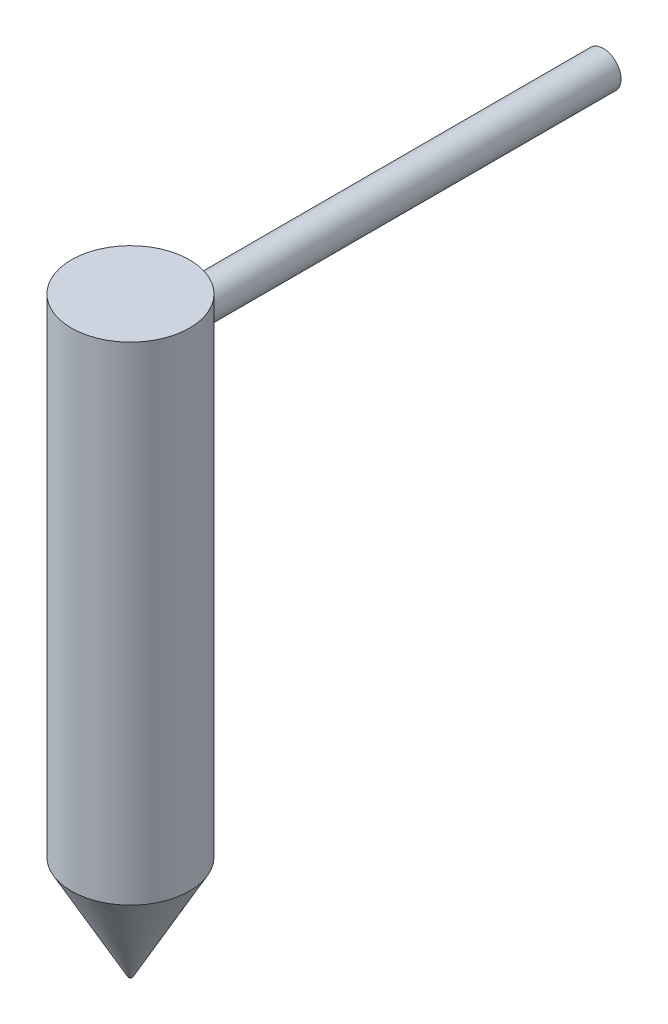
ISO-10303-21;
HEADER;
FILE_DESCRIPTION(('STEP AP214'),'2;1');
FILE_NAME('part.step','',(''),(''),'','','');
FILE_SCHEMA(('AUTOMOTIVE_DESIGN { 1 0 10303 214 1 1 1 1 }'));
ENDSEC;
DATA;
#1=APPLICATION_CONTEXT('core data for automotive mechanical design processes');
#2=APPLICATION_PROTOCOL_DEFINITION('international standard','automotive_design',2000,#1);
#3=PRODUCT_CONTEXT('',#1,'mechanical');
#4=PRODUCT('Part','Part','',(#3));
#5=PRODUCT_RELATED_PRODUCT_CATEGORY('part','',(#4));
#6=PRODUCT_DEFINITION_FORMATION('','',#4);
#7=PRODUCT_DEFINITION_CONTEXT('part definition',#1,'design');
#8=PRODUCT_DEFINITION('design','',#6,#7);
#9=PRODUCT_DEFINITION_SHAPE('','',#8);
#10=(LENGTH_UNIT() NAMED_UNIT(*) SI_UNIT(.MILLI.,.METRE.));
#11=(NAMED_UNIT(*) PLANE_ANGLE_UNIT() SI_UNIT($,.RADIAN.));
#12=(NAMED_UNIT(*) SI_UNIT($,.STERADIAN.) SOLID_ANGLE_UNIT());
#13=UNCERTAINTY_MEASURE_WITH_UNIT(LENGTH_MEASURE(1.E-05),#10,'distance_accuracy_value','');
#14=(GEOMETRIC_REPRESENTATION_CONTEXT(3) GLOBAL_UNCERTAINTY_ASSIGNED_CONTEXT((#13)) GLOBAL_UNIT_ASSIGNED_CONTEXT((#10,
#11,#12)) REPRESENTATION_CONTEXT('',''));
#15=CARTESIAN_POINT('',(0.,0.,0.));
#16=DIRECTION('',(0.,0.,1.));
#17=DIRECTION('',(1.,0.,0.));
#18=AXIS2_PLACEMENT_3D('',#15,#16,#17);
#19=CARTESIAN_POINT('',(0.,-500.,0.));
#20=DIRECTION('',(0.,1.,0.));
#21=DIRECTION('',(0.,0.,1.));
#22=AXIS2_PLACEMENT_3D('',#19,#20,#21);
#23=CYLINDRICAL_SURFACE('',#22,50.);
#24=CARTESIAN_POINT('',(15.,-35.1316147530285,-47.6969600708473));
#25=CARTESIAN_POINT('',(14.9999991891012,-35.5426036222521,-47.6969606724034));
#26=CARTESIAN_POINT('',(14.9830945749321,-35.953606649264,-47.7022865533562));
#27=CARTESIAN_POINT('',(14.9156320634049,-36.7725774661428,-47.7234235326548));
#28=CARTESIAN_POINT('',(14.86507260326,-37.1805451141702,-47.7392351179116));
#29=CARTESIAN_POINT('',(14.730748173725,-37.9905752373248,-47.780853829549));
#30=CARTESIAN_POINT('',(14.6469736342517,-38.3926359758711,-47.8066638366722));
#31=CARTESIAN_POINT('',(14.4469666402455,-39.1878771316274,-47.8674843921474));
#32=CARTESIAN_POINT('',(14.3307343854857,-39.5810576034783,-47.9024948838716));
#33=CARTESIAN_POINT('',(14.0670197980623,-40.3552044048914,-47.9805982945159));
#34=CARTESIAN_POINT('',(13.9195908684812,-40.7361903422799,-48.0236773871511));
#35=CARTESIAN_POINT('',(13.5945325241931,-41.484171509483,-48.1167044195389));
#36=CARTESIAN_POINT('',(13.4169030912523,-41.8511667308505,-48.1666523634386));
#37=CARTESIAN_POINT('',(13.0327386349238,-42.5689145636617,-48.2720144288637));
#38=CARTESIAN_POINT('',(12.8262010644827,-42.9196657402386,-48.3274290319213));
#39=CARTESIAN_POINT('',(12.3856475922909,-43.6027976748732,-48.4422081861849));
#40=CARTESIAN_POINT('',(12.1516302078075,-43.9351774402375,-48.5015729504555));
#41=CARTESIAN_POINT('',(11.650553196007,-44.5888351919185,-48.6244076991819));
#42=CARTESIAN_POINT('',(11.3827386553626,-44.9095217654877,-48.6879465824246));
#43=CARTESIAN_POINT('',(10.8213882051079,-45.5273725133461,-48.8157802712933));
#44=CARTESIAN_POINT('',(10.5278518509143,-45.8245362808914,-48.8800750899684));
#45=CARTESIAN_POINT('',(9.91686644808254,-46.3934989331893,-49.0076845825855));
#46=CARTESIAN_POINT('',(9.59941401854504,-46.6652942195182,-49.0709991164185));
#47=CARTESIAN_POINT('',(8.94262153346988,-47.1816779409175,-49.1949304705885));
#48=CARTESIAN_POINT('',(8.60328211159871,-47.4262671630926,-49.255547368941));
#49=CARTESIAN_POINT('',(7.89757572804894,-47.8913385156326,-49.373666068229));
#50=CARTESIAN_POINT('',(7.53079401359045,-48.1112150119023,-49.4310771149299));
#51=CARTESIAN_POINT('',(6.77907492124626,-48.5191844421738,-49.5397653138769));
#52=CARTESIAN_POINT('',(6.39413721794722,-48.7072768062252,-49.5910423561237));
#53=CARTESIAN_POINT('',(5.60884546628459,-49.0501049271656,-49.6859862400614));
#54=CARTESIAN_POINT('',(5.2084940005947,-49.2048462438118,-49.7296543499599));
#55=CARTESIAN_POINT('',(4.39521812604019,-49.4796554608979,-49.8081209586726));
#56=CARTESIAN_POINT('',(3.98229414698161,-49.5997245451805,-49.8429197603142));
#57=CARTESIAN_POINT('',(3.15893611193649,-49.8011606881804,-49.9017691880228));
#58=CARTESIAN_POINT('',(2.74876867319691,-49.8835365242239,-49.9260987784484));
#59=CARTESIAN_POINT('',(1.92252240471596,-50.0137787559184,-49.9647368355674));
#60=CARTESIAN_POINT('',(1.50644367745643,-50.0616457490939,-49.9790454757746));
#61=CARTESIAN_POINT('',(0.671588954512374,-50.1224155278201,-49.9972325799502));
#62=CARTESIAN_POINT('',(0.252813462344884,-50.1353246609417,-50.0011129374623));
#63=CARTESIAN_POINT('',(-0.584310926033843,-50.1260732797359,-49.9983376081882));
#64=CARTESIAN_POINT('',(-1.00265982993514,-50.1039134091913,-49.9916821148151));
#65=CARTESIAN_POINT('',(-1.8224464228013,-50.0260024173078,-49.9684046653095));
#66=CARTESIAN_POINT('',(-2.22399789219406,-49.9713453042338,-49.9521073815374));
#67=CARTESIAN_POINT('',(-3.02088653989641,-49.8298460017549,-49.9102538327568));
#68=CARTESIAN_POINT('',(-3.41622387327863,-49.7430046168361,-49.8846977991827));
#69=CARTESIAN_POINT('',(-4.19799578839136,-49.5378688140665,-49.8249991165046));
#70=CARTESIAN_POINT('',(-4.58443004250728,-49.4195732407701,-49.7908561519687));
#71=CARTESIAN_POINT('',(-5.34583052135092,-49.1524874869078,-49.7148719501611));
#72=CARTESIAN_POINT('',(-5.72079652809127,-49.0036967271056,-49.6730305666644));
#73=CARTESIAN_POINT('',(-6.46114855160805,-48.6748612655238,-49.582197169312));
#74=CARTESIAN_POINT('',(-6.82637261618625,-48.494473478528,-49.5331277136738));
#75=CARTESIAN_POINT('',(-7.54035022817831,-48.1049910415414,-49.4294777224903));
#76=CARTESIAN_POINT('',(-7.88910371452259,-47.8958962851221,-49.3748971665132));
#77=CARTESIAN_POINT('',(-8.56809494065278,-47.4504074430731,-49.2616103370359));
#78=CARTESIAN_POINT('',(-8.89832926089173,-47.2140083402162,-49.202903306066));
#79=CARTESIAN_POINT('',(-9.53827363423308,-46.715477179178,-49.0828620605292));
#80=CARTESIAN_POINT('',(-9.84798264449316,-46.4533438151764,-49.0215277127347));
#81=CARTESIAN_POINT('',(-10.4565672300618,-45.8943937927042,-48.8954033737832));
#82=CARTESIAN_POINT('',(-10.7545643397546,-45.5966294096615,-48.8305713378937));
#83=CARTESIAN_POINT('',(-11.3245385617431,-44.9770214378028,-48.7015424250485));
#84=CARTESIAN_POINT('',(-11.596514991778,-44.655177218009,-48.6373455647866));
#85=CARTESIAN_POINT('',(-12.1126770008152,-43.9894073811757,-48.5113765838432));
#86=CARTESIAN_POINT('',(-12.3568590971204,-43.6454790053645,-48.4496047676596));
#87=CARTESIAN_POINT('',(-12.8156822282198,-42.9377738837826,-48.3302648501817));
#88=CARTESIAN_POINT('',(-13.0303244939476,-42.5739979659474,-48.2726965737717));
#89=CARTESIAN_POINT('',(-13.4304128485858,-41.8253341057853,-48.1629264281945));
#90=CARTESIAN_POINT('',(-13.6155568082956,-41.4402761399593,-48.1107817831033));
#91=CARTESIAN_POINT('',(-13.9526145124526,-40.6549409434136,-48.014115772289));
#92=CARTESIAN_POINT('',(-14.1045278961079,-40.2546635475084,-47.9695944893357));
#93=CARTESIAN_POINT('',(-14.3737591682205,-39.4418668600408,-47.8896104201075));
#94=CARTESIAN_POINT('',(-14.4910863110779,-39.0293508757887,-47.8541452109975));
#95=CARTESIAN_POINT('',(-14.6901019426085,-38.1950747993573,-47.7934279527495));
#96=CARTESIAN_POINT('',(-14.7717918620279,-37.7733150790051,-47.7681754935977));
#97=CARTESIAN_POINT('',(-14.8963695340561,-36.9396846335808,-47.729469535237));
#98=CARTESIAN_POINT('',(-14.9405905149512,-36.5280315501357,-47.7156112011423));
#99=CARTESIAN_POINT('',(-14.9948510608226,-35.702261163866,-47.698587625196));
#100=CARTESIAN_POINT('',(-15.0048914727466,-35.2881439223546,-47.6954221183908));
#101=CARTESIAN_POINT('',(-14.990696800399,-34.4606109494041,-47.699885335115));
#102=CARTESIAN_POINT('',(-14.9664660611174,-34.047195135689,-47.7075126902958));
#103=CARTESIAN_POINT('',(-14.8839676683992,-33.2241108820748,-47.7333150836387));
#104=CARTESIAN_POINT('',(-14.8257002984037,-32.8144424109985,-47.7514900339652));
#105=CARTESIAN_POINT('',(-14.6776285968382,-32.0124557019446,-47.7972074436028));
#106=CARTESIAN_POINT('',(-14.588684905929,-31.619963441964,-47.824493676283));
#107=CARTESIAN_POINT('',(-14.3797846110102,-30.8440498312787,-47.8877196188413));
#108=CARTESIAN_POINT('',(-14.2598286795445,-30.4606282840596,-47.9236591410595));
#109=CARTESIAN_POINT('',(-13.989851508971,-29.7052961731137,-48.0031648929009));
#110=CARTESIAN_POINT('',(-13.8398268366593,-29.3333869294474,-48.0467319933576));
#111=CARTESIAN_POINT('',(-13.5108498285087,-28.6034284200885,-48.1402758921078));
#112=CARTESIAN_POINT('',(-13.3318966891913,-28.2453795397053,-48.1902528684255));
#113=CARTESIAN_POINT('',(-12.9411477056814,-27.5358869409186,-48.2966745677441));
#114=CARTESIAN_POINT('',(-12.728599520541,-27.1848781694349,-48.3532568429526));
#115=CARTESIAN_POINT('',(-12.275806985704,-26.5018723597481,-48.4701889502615));
#116=CARTESIAN_POINT('',(-12.0355622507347,-26.1698755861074,-48.530538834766));
#117=CARTESIAN_POINT('',(-11.5288927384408,-25.5268124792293,-48.653392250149));
#118=CARTESIAN_POINT('',(-11.2624624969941,-25.2157505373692,-48.7158962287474));
#119=CARTESIAN_POINT('',(-10.7051233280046,-24.6164933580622,-48.8413955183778));
#120=CARTESIAN_POINT('',(-10.4142139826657,-24.3282985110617,-48.9043908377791));
#121=CARTESIAN_POINT('',(-9.79823995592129,-23.766102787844,-49.0315925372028));
#122=CARTESIAN_POINT('',(-9.47229995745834,-23.4930499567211,-49.0957547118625));
#123=CARTESIAN_POINT('',(-8.79804089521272,-22.9753346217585,-49.2210528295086));
#124=CARTESIAN_POINT('',(-8.44972121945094,-22.7306728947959,-49.2821886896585));
#125=CARTESIAN_POINT('',(-7.73297964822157,-22.2715156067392,-49.3997255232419));
#126=CARTESIAN_POINT('',(-7.36455819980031,-22.0570193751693,-49.4561266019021));
#127=CARTESIAN_POINT('',(-6.61007136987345,-21.6598407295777,-49.5626076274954));
#128=CARTESIAN_POINT('',(-6.22400632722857,-21.4771577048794,-49.6126876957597));
#129=CARTESIAN_POINT('',(-5.43989725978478,-21.1463655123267,-49.704749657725));
#130=CARTESIAN_POINT('',(-5.0419666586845,-20.9980039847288,-49.7467902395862));
#131=CARTESIAN_POINT('',(-4.23418833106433,-20.7353648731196,-49.8220449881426));
#132=CARTESIAN_POINT('',(-3.82434061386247,-20.6210872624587,-49.8552591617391));
#133=CARTESIAN_POINT('',(-2.99586652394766,-20.4276805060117,-49.9118936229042));
#134=CARTESIAN_POINT('',(-2.57724226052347,-20.3485430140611,-49.9353162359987));
#135=CARTESIAN_POINT('',(-1.734336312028,-20.2261316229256,-49.971691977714));
#136=CARTESIAN_POINT('',(-1.31005481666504,-20.1828565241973,-49.9846454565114));
#137=CARTESIAN_POINT('',(-0.475570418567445,-20.1335566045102,-49.9994123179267));
#138=CARTESIAN_POINT('',(-0.0654551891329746,-20.1261603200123,-50.00163583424));
#139=CARTESIAN_POINT('',(0.753926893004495,-20.1449701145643,-49.9959941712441));
#140=CARTESIAN_POINT('',(1.16319376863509,-20.171175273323,-49.9881292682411));
#141=CARTESIAN_POINT('',(1.97787465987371,-20.2569459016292,-49.9625270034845));
#142=CARTESIAN_POINT('',(2.38328890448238,-20.3165093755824,-49.9447902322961));
#143=CARTESIAN_POINT('',(3.18738597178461,-20.4684640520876,-49.899927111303));
#144=CARTESIAN_POINT('',(3.58606876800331,-20.5608553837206,-49.8728007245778));
#145=CARTESIAN_POINT('',(4.36966666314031,-20.7764982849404,-49.8102283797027));
#146=CARTESIAN_POINT('',(4.75468386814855,-20.8994063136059,-49.7748752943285));
#147=CARTESIAN_POINT('',(5.51286866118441,-21.1755744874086,-49.6966149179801));
#148=CARTESIAN_POINT('',(5.88603638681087,-21.3288342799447,-49.6537077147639));
#149=CARTESIAN_POINT('',(6.61820550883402,-21.6645596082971,-49.5614319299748));
#150=CARTESIAN_POINT('',(6.97720532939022,-21.8470283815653,-49.51206263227));
#151=CARTESIAN_POINT('',(7.67882469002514,-22.2398609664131,-49.4081111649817));
#152=CARTESIAN_POINT('',(8.0214433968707,-22.4502261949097,-49.3535287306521));
#153=CARTESIAN_POINT('',(8.69893927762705,-22.9045917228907,-49.2387068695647));
#154=CARTESIAN_POINT('',(9.03321823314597,-23.1494526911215,-49.1783423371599));
#155=CARTESIAN_POINT('',(9.68011207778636,-23.6657221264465,-49.0551105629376));
#156=CARTESIAN_POINT('',(9.99272653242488,-23.9371311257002,-48.9922432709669));
#157=CARTESIAN_POINT('',(10.5943945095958,-24.5047682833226,-48.8656662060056));
#158=CARTESIAN_POINT('',(10.883446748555,-24.800997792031,-48.8019563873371));
#159=CARTESIAN_POINT('',(11.4362960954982,-25.4165568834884,-48.6753695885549));
#160=CARTESIAN_POINT('',(11.7000821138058,-25.735896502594,-48.6124929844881));
#161=CARTESIAN_POINT('',(12.208045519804,-26.4054791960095,-48.4874632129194));
#162=CARTESIAN_POINT('',(12.4514016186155,-26.7563605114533,-48.4253877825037));
#163=CARTESIAN_POINT('',(12.9075276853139,-27.4779980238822,-48.3058104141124));
#164=CARTESIAN_POINT('',(13.1203109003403,-27.8487455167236,-48.2483065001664));
#165=CARTESIAN_POINT('',(13.5137515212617,-28.6077204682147,-48.1395906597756));
#166=CARTESIAN_POINT('',(13.6944145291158,-28.9959448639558,-48.0883776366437));
#167=CARTESIAN_POINT('',(14.0221568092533,-29.7872291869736,-47.9938354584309));
#168=CARTESIAN_POINT('',(14.1692393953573,-30.1902876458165,-47.9505055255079));
#169=CARTESIAN_POINT('',(14.4145316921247,-30.9641456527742,-47.8772996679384));
#170=CARTESIAN_POINT('',(14.5163031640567,-31.3337308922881,-47.8464763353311));
#171=CARTESIAN_POINT('',(14.691342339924,-32.0801596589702,-47.7930209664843));
#172=CARTESIAN_POINT('',(14.7646122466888,-32.4570026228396,-47.770388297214));
#173=CARTESIAN_POINT('',(14.8820689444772,-33.2155521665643,-47.7339272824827));
#174=CARTESIAN_POINT('',(14.9262607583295,-33.597257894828,-47.7200974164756));
#175=CARTESIAN_POINT('',(14.9852275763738,-34.3631764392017,-47.7016132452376));
#176=CARTESIAN_POINT('',(15.0000007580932,-34.747389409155,-47.6969595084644));
#177=CARTESIAN_POINT('',(15.,-35.1316147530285,-47.6969600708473));
#178=B_SPLINE_CURVE_WITH_KNOTS('',3,(#24,#25,#26,#27,#28,#29,#30,#31,#32,#33,#34,#35,#36,#37,
#38,#39,#40,#41,#42,#43,#44,#45,#46,#47,#48,#49,#50,#51,#52,#53,#54,#55,#56,#57,#58,#59,#60,#61,
#62,#63,#64,#65,#66,#67,#68,#69,#70,#71,#72,#73,#74,#75,#76,#77,#78,#79,#80,#81,#82,#83,#84,#85,
#86,#87,#88,#89,#90,#91,#92,#93,#94,#95,#96,#97,#98,#99,#100,#101,#102,#103,#104,#105,#106,#107,
#108,#109,#110,#111,#112,#113,#114,#115,#116,#117,#118,#119,#120,#121,#122,#123,#124,#125,#126,
#127,#128,#129,#130,#131,#132,#133,#134,#135,#136,#137,#138,#139,#140,#141,#142,#143,#144,#145,
#146,#147,#148,#149,#150,#151,#152,#153,#154,#155,#156,#157,#158,#159,#160,#161,#162,#163,#164,
#165,#166,#167,#168,#169,#170,#171,#172,#173,#174,#175,#176,#177),.UNSPECIFIED.,.T.,.F.,(4,2,2,
2,2,2,2,2,2,2,2,2,2,2,2,2,2,2,2,2,2,2,2,2,2,2,2,2,2,2,2,2,2,2,2,2,2,2,2,2,2,2,2,2,2,2,2,2,2,2,2,
2,2,2,2,2,2,2,2,2,2,2,2,2,2,2,2,2,2,2,2,2,2,2,2,2,4),(0.,1.23261087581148,2.46527899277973,
3.69830253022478,4.93131847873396,6.16224055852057,7.39316338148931,8.62419472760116,
9.85529252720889,11.1216825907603,12.3880945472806,13.654685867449,14.9212405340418,
16.2140799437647,17.5069425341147,18.7995894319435,20.0921921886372,21.3478219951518,
22.603430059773,23.8588101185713,25.1141671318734,26.3294819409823,27.54476637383,
28.7600954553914,29.9754476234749,31.2049223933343,32.4344017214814,33.6641073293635,
34.8938753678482,36.1710714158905,37.4483009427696,38.7256903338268,40.0030264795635,
41.292704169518,42.5823958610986,43.8717421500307,45.1610366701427,46.4022577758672,
47.6434481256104,48.8844811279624,50.1255037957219,51.3342135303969,52.5428970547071,
53.7517186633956,54.9605738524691,56.2018621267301,57.4431676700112,58.6847327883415,
59.9263191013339,61.2148280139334,62.5033721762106,63.7918876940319,65.0803784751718,
66.3590706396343,67.6377618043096,68.9161491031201,70.1944936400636,71.4235664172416,
72.6526055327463,73.881571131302,75.1105415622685,76.3262587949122,77.541961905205,
78.7577998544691,79.9736995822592,81.2284936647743,82.4833129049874,83.7382004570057,
84.993636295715,86.2865799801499,87.5789617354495,88.8711178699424,90.1631464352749,
91.3157067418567,92.4681779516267,93.6204500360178,94.7727935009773),.UNSPECIFIED.);
#179=CARTESIAN_POINT('',(15.,-35.1316147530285,-47.6969600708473));
#180=VERTEX_POINT('',#179);
#181=EDGE_CURVE('E10',#180,#180,#178,.T.);
#182=ORIENTED_EDGE('',*,*,#181,.F.);
#183=EDGE_LOOP('',(#182));
#184=FACE_BOUND('',#183,.T.);
#185=CARTESIAN_POINT('',(0.,0.,0.));
#186=DIRECTION('',(0.,1.,0.));
#187=DIRECTION('',(0.,0.,1.));
#188=AXIS2_PLACEMENT_3D('',#185,#186,#187);
#189=CIRCLE('',#188,50.);
#190=CARTESIAN_POINT('',(0.,0.,50.));
#191=VERTEX_POINT('',#190);
#192=EDGE_CURVE('E44',#191,#191,#189,.T.);
#193=ORIENTED_EDGE('',*,*,#192,.F.);
#194=EDGE_LOOP('',(#193));
#195=FACE_BOUND('',#194,.T.);
#196=CARTESIAN_POINT('',(0.,-412.457898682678,0.));
#197=DIRECTION('',(0.,1.,0.));
#198=DIRECTION('',(0.,0.,1.));
#199=AXIS2_PLACEMENT_3D('',#196,#197,#198);
#200=CIRCLE('',#199,50.);
#201=CARTESIAN_POINT('',(0.,-412.457898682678,50.));
#202=VERTEX_POINT('',#201);
#203=EDGE_CURVE('E48',#202,#202,#200,.T.);
#204=ORIENTED_EDGE('',*,*,#203,.T.);
#205=EDGE_LOOP('',(#204));
#206=FACE_BOUND('',#205,.T.);
#207=ADVANCED_FACE('F33',(#184,#195,#206),#23,.T.);
#208=CARTESIAN_POINT('',(0.,0.,0.));
#209=DIRECTION('',(0.,1.,0.));
#210=DIRECTION('',(0.,0.,1.));
#211=AXIS2_PLACEMENT_3D('',#208,#209,#210);
#212=PLANE('',#211);
#213=ORIENTED_EDGE('',*,*,#192,.T.);
#214=EDGE_LOOP('',(#213));
#215=FACE_BOUND('',#214,.T.);
#216=ADVANCED_FACE('F71',(#215),#212,.T.);
#217=CARTESIAN_POINT('',(0.,-388.984133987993,0.));
#218=DIRECTION('',(0.,1.,0.));
#219=DIRECTION('',(0.,0.,1.));
#220=AXIS2_PLACEMENT_3D('',#217,#218,#219);
#221=CONICAL_SURFACE('',#220,62.9784416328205,0.505060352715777);
#222=CARTESIAN_POINT('',(0.,-500.,0.));
#223=DIRECTION('',(0.,1.,0.));
#224=DIRECTION('',(0.,0.,1.));
#225=AXIS2_PLACEMENT_3D('',#222,#223,#224);
#226=CIRCLE('',#225,1.59872874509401);
#227=CARTESIAN_POINT('',(0.,-500.,1.59872874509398));
#228=VERTEX_POINT('',#227);
#229=EDGE_CURVE('E52',#228,#228,#226,.T.);
#230=CARTESIAN_POINT('',(0.,-412.457898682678,50.));
#231=CARTESIAN_POINT('',(0.,-413.369795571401,49.4958200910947));
#232=CARTESIAN_POINT('',(0.,-414.281692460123,48.9916401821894));
#233=CARTESIAN_POINT('',(0.,-416.105486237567,47.9832803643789));
#234=CARTESIAN_POINT('',(0.,-417.017383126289,47.4791004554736));
#235=CARTESIAN_POINT('',(0.,-418.841176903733,46.4707406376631));
#236=CARTESIAN_POINT('',(0.,-419.753073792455,45.9665607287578));
#237=CARTESIAN_POINT('',(0.,-421.576867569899,44.9582009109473));
#238=CARTESIAN_POINT('',(0.,-422.488764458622,44.454021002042));
#239=CARTESIAN_POINT('',(0.,-424.312558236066,43.4456611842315));
#240=CARTESIAN_POINT('',(0.,-425.224455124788,42.9414812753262));
#241=CARTESIAN_POINT('',(0.,-427.048248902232,41.9331214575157));
#242=CARTESIAN_POINT('',(0.,-427.960145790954,41.4289415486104));
#243=CARTESIAN_POINT('',(0.,-429.783939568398,40.4205817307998));
#244=CARTESIAN_POINT('',(0.,-430.69583645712,39.9164018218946));
#245=CARTESIAN_POINT('',(0.,-432.519630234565,38.908042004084));
#246=CARTESIAN_POINT('',(0.,-433.431527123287,38.4038620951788));
#247=CARTESIAN_POINT('',(0.,-435.255320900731,37.3955022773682));
#248=CARTESIAN_POINT('',(0.,-436.167217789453,36.8913223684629));
#249=CARTESIAN_POINT('',(0.,-437.991011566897,35.8829625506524));
#250=CARTESIAN_POINT('',(0.,-438.902908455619,35.3787826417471));
#251=CARTESIAN_POINT('',(0.,-440.726702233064,34.3704228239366));
#252=CARTESIAN_POINT('',(0.,-441.638599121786,33.8662429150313));
#253=CARTESIAN_POINT('',(0.,-443.46239289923,32.8578830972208));
#254=CARTESIAN_POINT('',(0.,-444.374289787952,32.3537031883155));
#255=CARTESIAN_POINT('',(0.,-446.198083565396,31.345343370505));
#256=CARTESIAN_POINT('',(0.,-447.109980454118,30.8411634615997));
#257=CARTESIAN_POINT('',(0.,-448.933774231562,29.8328036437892));
#258=CARTESIAN_POINT('',(0.,-449.845671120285,29.3286237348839));
#259=CARTESIAN_POINT('',(0.,-451.669464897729,28.3202639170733));
#260=CARTESIAN_POINT('',(0.,-452.581361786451,27.8160840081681));
#261=CARTESIAN_POINT('',(0.,-454.405155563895,26.8077241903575));
#262=CARTESIAN_POINT('',(0.,-455.317052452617,26.3035442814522));
#263=CARTESIAN_POINT('',(0.,-457.140846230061,25.2951844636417));
#264=CARTESIAN_POINT('',(0.,-458.052743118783,24.7910045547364));
#265=CARTESIAN_POINT('',(0.,-459.876536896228,23.7826447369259));
#266=CARTESIAN_POINT('',(0.,-460.78843378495,23.2784648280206));
#267=CARTESIAN_POINT('',(0.,-462.612227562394,22.2701050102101));
#268=CARTESIAN_POINT('',(0.,-463.524124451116,21.7659251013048));
#269=CARTESIAN_POINT('',(0.,-465.34791822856,20.7575652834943));
#270=CARTESIAN_POINT('',(0.,-466.259815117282,20.253385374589));
#271=CARTESIAN_POINT('',(0.,-468.083608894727,19.2450255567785));
#272=CARTESIAN_POINT('',(0.,-468.995505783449,18.7408456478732));
#273=CARTESIAN_POINT('',(0.,-470.819299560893,17.7324858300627));
#274=CARTESIAN_POINT('',(0.,-471.731196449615,17.2283059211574));
#275=CARTESIAN_POINT('',(0.,-473.554990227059,16.2199461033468));
#276=CARTESIAN_POINT('',(0.,-474.466887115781,15.7157661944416));
#277=CARTESIAN_POINT('',(0.,-476.290680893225,14.707406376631));
#278=CARTESIAN_POINT('',(0.,-477.202577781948,14.2032264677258));
#279=CARTESIAN_POINT('',(0.,-479.026371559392,13.1948666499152));
#280=CARTESIAN_POINT('',(0.,-479.938268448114,12.6906867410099));
#281=CARTESIAN_POINT('',(0.,-481.762062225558,11.6823269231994));
#282=CARTESIAN_POINT('',(0.,-482.67395911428,11.1781470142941));
#283=CARTESIAN_POINT('',(0.,-484.497752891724,10.1697871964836));
#284=CARTESIAN_POINT('',(0.,-485.409649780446,9.66560728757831));
#285=CARTESIAN_POINT('',(0.,-487.233443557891,8.65724746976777));
#286=CARTESIAN_POINT('',(0.,-488.145340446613,8.1530675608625));
#287=CARTESIAN_POINT('',(0.,-489.969134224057,7.14470774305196));
#288=CARTESIAN_POINT('',(0.,-490.881031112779,6.64052783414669));
#289=CARTESIAN_POINT('',(0.,-492.704824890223,5.63216801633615));
#290=CARTESIAN_POINT('',(0.,-493.616721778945,5.12798810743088));
#291=CARTESIAN_POINT('',(0.,-495.44051555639,4.11962828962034));
#292=CARTESIAN_POINT('',(0.,-496.352412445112,3.61544838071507));
#293=CARTESIAN_POINT('',(0.,-498.176206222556,2.60708856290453));
#294=CARTESIAN_POINT('',(0.,-499.088103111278,2.10290865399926));
#295=CARTESIAN_POINT('',(0.,-500.,1.59872874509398));
#296=B_SPLINE_CURVE_WITH_KNOTS('',3,(#230,#231,#232,#233,#234,#235,#236,#237,#238,#239,#240,
#241,#242,#243,#244,#245,#246,#247,#248,#249,#250,#251,#252,#253,#254,#255,#256,#257,#258,#259,
#260,#261,#262,#263,#264,#265,#266,#267,#268,#269,#270,#271,#272,#273,#274,#275,#276,#277,#278,
#279,#280,#281,#282,#283,#284,#285,#286,#287,#288,#289,#290,#291,#292,#293,#294,#295),
.UNSPECIFIED.,.F.,.F.,(4,2,2,2,2,2,2,2,2,2,2,2,2,2,2,2,2,2,2,2,2,2,2,2,2,2,2,2,2,2,2,2,4),(0.,
3.12598462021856,6.25196924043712,9.37795386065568,12.5039384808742,15.6299231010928,
18.7559077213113,21.8818923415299,25.0078769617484,28.133861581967,31.2598462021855,
34.3858308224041,37.5118154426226,40.6378000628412,43.7637846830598,46.8897693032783,
50.0157539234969,53.1417385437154,56.267723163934,59.3937077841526,62.5196924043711,
65.6456770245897,68.7716616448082,71.8976462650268,75.0236308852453,78.1496155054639,
81.2756001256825,84.401584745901,87.5275693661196,90.6535539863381,93.7795386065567,
96.9055232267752,100.031507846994),.UNSPECIFIED.);
#297=EDGE_CURVE('BSEAM76',#202,#228,#296,.T.);
#298=ORIENTED_EDGE('',*,*,#203,.F.);
#299=ORIENTED_EDGE('',*,*,#229,.T.);
#300=ORIENTED_EDGE('',*,*,#297,.T.);
#301=ORIENTED_EDGE('',*,*,#297,.F.);
#302=EDGE_LOOP('',(#298,#300,#299,#301));
#303=FACE_BOUND('',#302,.T.);
#304=ADVANCED_FACE('F76',(#303),#221,.T.);
#305=CARTESIAN_POINT('',(0.,-500.,0.));
#306=DIRECTION('',(0.,1.,0.));
#307=DIRECTION('',(0.,0.,1.));
#308=AXIS2_PLACEMENT_3D('',#305,#306,#307);
#309=PLANE('',#308);
#310=ORIENTED_EDGE('',*,*,#229,.F.);
#311=EDGE_LOOP('',(#310));
#312=FACE_BOUND('',#311,.T.);
#313=ADVANCED_FACE('F69',(#312),#309,.F.);
#314=CARTESIAN_POINT('',(0.,-35.1316147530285,-400.));
#315=DIRECTION('',(0.,0.,1.));
#316=DIRECTION('',(1.,0.,0.));
#317=AXIS2_PLACEMENT_3D('',#314,#315,#316);
#318=CYLINDRICAL_SURFACE('',#317,15.);
#319=ORIENTED_EDGE('',*,*,#181,.T.);
#320=EDGE_LOOP('',(#319));
#321=FACE_BOUND('',#320,.T.);
#322=CARTESIAN_POINT('',(0.,-35.1316147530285,-400.));
#323=DIRECTION('',(0.,0.,1.));
#324=DIRECTION('',(1.,0.,0.));
#325=AXIS2_PLACEMENT_3D('',#322,#323,#324);
#326=CIRCLE('',#325,15.);
#327=CARTESIAN_POINT('',(15.,-35.1316147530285,-400.));
#328=VERTEX_POINT('',#327);
#329=EDGE_CURVE('E57',#328,#328,#326,.T.);
#330=ORIENTED_EDGE('',*,*,#329,.T.);
#331=EDGE_LOOP('',(#330));
#332=FACE_BOUND('',#331,.T.);
#333=ADVANCED_FACE('F61',(#321,#332),#318,.T.);
#334=CARTESIAN_POINT('',(0.,-35.1316147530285,-400.));
#335=DIRECTION('',(0.,0.,1.));
#336=DIRECTION('',(1.,0.,0.));
#337=AXIS2_PLACEMENT_3D('',#334,#335,#336);
#338=PLANE('',#337);
#339=ORIENTED_EDGE('',*,*,#329,.F.);
#340=EDGE_LOOP('',(#339));
#341=FACE_BOUND('',#340,.T.);
#342=ADVANCED_FACE('F63',(#341),#338,.F.);
#343=CLOSED_SHELL('',(#207,#216,#304,#313,#333,#342));
#344=MANIFOLD_SOLID_BREP('B2',#343);
#345=ADVANCED_BREP_SHAPE_REPRESENTATION('',(#18,#344),#14);
#346=SHAPE_DEFINITION_REPRESENTATION(#9,#345);
ENDSEC;
END-ISO-10303-21;
